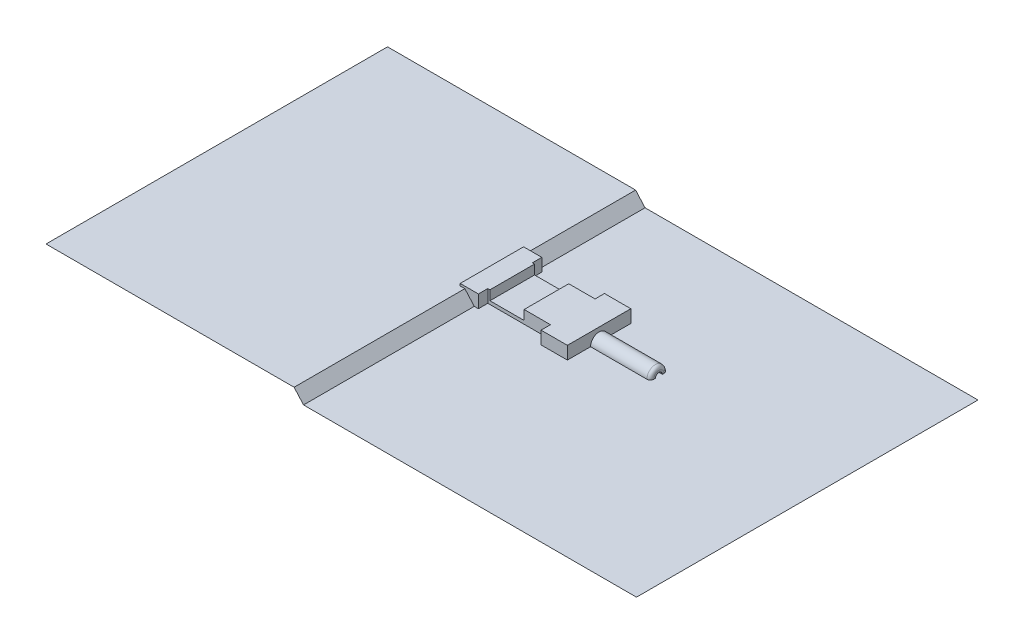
ISO-10303-21;
HEADER;
FILE_DESCRIPTION(('STEP AP214'),'2;1');
FILE_NAME('part.step','',(''),(''),'','','');
FILE_SCHEMA(('AUTOMOTIVE_DESIGN { 1 0 10303 214 1 1 1 1 }'));
ENDSEC;
DATA;
#1=APPLICATION_CONTEXT('core data for automotive mechanical design processes');
#2=APPLICATION_PROTOCOL_DEFINITION('international standard','automotive_design',2000,#1);
#3=PRODUCT_CONTEXT('',#1,'mechanical');
#4=PRODUCT('Part','Part','',(#3));
#5=PRODUCT_RELATED_PRODUCT_CATEGORY('part','',(#4));
#6=PRODUCT_DEFINITION_FORMATION('','',#4);
#7=PRODUCT_DEFINITION_CONTEXT('part definition',#1,'design');
#8=PRODUCT_DEFINITION('design','',#6,#7);
#9=PRODUCT_DEFINITION_SHAPE('','',#8);
#10=(LENGTH_UNIT() NAMED_UNIT(*) SI_UNIT(.MILLI.,.METRE.));
#11=(NAMED_UNIT(*) PLANE_ANGLE_UNIT() SI_UNIT($,.RADIAN.));
#12=(NAMED_UNIT(*) SI_UNIT($,.STERADIAN.) SOLID_ANGLE_UNIT());
#13=UNCERTAINTY_MEASURE_WITH_UNIT(LENGTH_MEASURE(1.E-05),#10,'distance_accuracy_value','');
#14=(GEOMETRIC_REPRESENTATION_CONTEXT(3) GLOBAL_UNCERTAINTY_ASSIGNED_CONTEXT((#13)) GLOBAL_UNIT_ASSIGNED_CONTEXT((#10,
#11,#12)) REPRESENTATION_CONTEXT('',''));
#15=CARTESIAN_POINT('',(0.,0.,0.));
#16=DIRECTION('',(0.,0.,1.));
#17=DIRECTION('',(1.,0.,0.));
#18=AXIS2_PLACEMENT_3D('',#15,#16,#17);
#19=CARTESIAN_POINT('',(-40.7086650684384,3.7238100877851,18.5695273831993));
#20=DIRECTION('',(0.,1.,0.));
#21=DIRECTION('',(0.,0.,1.));
#22=AXIS2_PLACEMENT_3D('',#19,#20,#21);
#23=PLANE('',#22);
#24=DIRECTION('',(-1.,0.,0.));
#25=VECTOR('',#24,1.);
#26=CARTESIAN_POINT('',(-40.7086650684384,3.7238100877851,118.569527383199));
#27=LINE('',#26,#25);
#28=CARTESIAN_POINT('',(-19.3295566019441,3.7238100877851,118.569527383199));
#29=VERTEX_POINT('',#28);
#30=CARTESIAN_POINT('',(-164.622270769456,3.7238100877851,118.569527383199));
#31=VERTEX_POINT('',#30);
#32=EDGE_CURVE('E50',#29,#31,#27,.T.);
#33=ORIENTED_EDGE('',*,*,#32,.F.);
#34=DIRECTION('',(0.,0.,1.));
#35=VECTOR('',#34,1.);
#36=CARTESIAN_POINT('',(-19.3295566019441,3.7238100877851,18.5695273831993));
#37=LINE('',#36,#35);
#38=CARTESIAN_POINT('',(-19.3295566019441,3.7238100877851,-81.4304726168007));
#39=VERTEX_POINT('',#38);
#40=EDGE_CURVE('E87',#39,#29,#37,.T.);
#41=ORIENTED_EDGE('',*,*,#40,.F.);
#42=DIRECTION('',(-1.,0.,0.));
#43=VECTOR('',#42,1.);
#44=CARTESIAN_POINT('',(-40.7086650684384,3.7238100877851,-81.4304726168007));
#45=LINE('',#44,#43);
#46=CARTESIAN_POINT('',(-164.622270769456,3.7238100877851,-81.4304726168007));
#47=VERTEX_POINT('',#46);
#48=EDGE_CURVE('E85',#39,#47,#45,.T.);
#49=ORIENTED_EDGE('',*,*,#48,.T.);
#50=DIRECTION('',(0.,0.,1.));
#51=VECTOR('',#50,1.);
#52=CARTESIAN_POINT('',(-164.622270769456,3.7238100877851,18.5695273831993));
#53=LINE('',#52,#51);
#54=EDGE_CURVE('E12',#47,#31,#53,.T.);
#55=ORIENTED_EDGE('',*,*,#54,.T.);
#56=EDGE_LOOP('',(#33,#41,#49,#55));
#57=FACE_BOUND('',#56,.T.);
#58=ADVANCED_FACE('F43',(#57),#23,.T.);
#59=CARTESIAN_POINT('',(-13.811539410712,-2.5,18.5695273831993));
#60=DIRECTION('',(0.748259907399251,0.663405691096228,0.));
#61=DIRECTION('',(-0.663405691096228,0.748259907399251,0.));
#62=AXIS2_PLACEMENT_3D('',#59,#60,#61);
#63=PLANE('',#62);
#64=DIRECTION('',(-0.663405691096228,0.748259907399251,0.));
#65=VECTOR('',#64,1.);
#66=CARTESIAN_POINT('',(-13.811539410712,-2.5,118.569527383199));
#67=LINE('',#66,#65);
#68=CARTESIAN_POINT('',(-13.811539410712,-2.5,118.569527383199));
#69=VERTEX_POINT('',#68);
#70=EDGE_CURVE('E65',#69,#29,#67,.T.);
#71=ORIENTED_EDGE('',*,*,#70,.F.);
#72=DIRECTION('',(0.,0.,1.));
#73=VECTOR('',#72,1.);
#74=CARTESIAN_POINT('',(-13.811539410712,-2.5,18.5695273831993));
#75=LINE('',#74,#73);
#76=CARTESIAN_POINT('',(-13.811539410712,-2.5,-81.4304726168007));
#77=VERTEX_POINT('',#76);
#78=EDGE_CURVE('E105',#77,#69,#75,.T.);
#79=ORIENTED_EDGE('',*,*,#78,.F.);
#80=DIRECTION('',(-0.663405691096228,0.748259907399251,0.));
#81=VECTOR('',#80,1.);
#82=CARTESIAN_POINT('',(-13.811539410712,-2.5,-81.4304726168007));
#83=LINE('',#82,#81);
#84=EDGE_CURVE('E89',#77,#39,#83,.T.);
#85=ORIENTED_EDGE('',*,*,#84,.T.);
#86=ORIENTED_EDGE('',*,*,#40,.T.);
#87=EDGE_LOOP('',(#71,#79,#85,#86));
#88=FACE_BOUND('',#87,.T.);
#89=ADVANCED_FACE('F110',(#88),#63,.T.);
#90=CARTESIAN_POINT('',(75.7086650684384,-2.5,18.5695273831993));
#91=DIRECTION('',(0.,1.,0.));
#92=DIRECTION('',(0.,0.,1.));
#93=AXIS2_PLACEMENT_3D('',#90,#91,#92);
#94=PLANE('',#93);
#95=DIRECTION('',(-1.,0.,0.));
#96=VECTOR('',#95,1.);
#97=CARTESIAN_POINT('',(75.7086650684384,-2.5,118.569527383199));
#98=LINE('',#97,#96);
#99=CARTESIAN_POINT('',(181.173511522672,-2.5,118.569527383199));
#100=VERTEX_POINT('',#99);
#101=EDGE_CURVE('E57',#100,#69,#98,.T.);
#102=ORIENTED_EDGE('',*,*,#101,.F.);
#103=DIRECTION('',(0.,0.,1.));
#104=VECTOR('',#103,1.);
#105=CARTESIAN_POINT('',(181.173511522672,-2.5,18.5695273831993));
#106=LINE('',#105,#104);
#107=CARTESIAN_POINT('',(181.173511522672,-2.5,-81.4304726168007));
#108=VERTEX_POINT('',#107);
#109=EDGE_CURVE('E96',#108,#100,#106,.T.);
#110=ORIENTED_EDGE('',*,*,#109,.F.);
#111=DIRECTION('',(-1.,0.,0.));
#112=VECTOR('',#111,1.);
#113=CARTESIAN_POINT('',(75.7086650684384,-2.5,-81.4304726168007));
#114=LINE('',#113,#112);
#115=EDGE_CURVE('E98',#108,#77,#114,.T.);
#116=ORIENTED_EDGE('',*,*,#115,.T.);
#117=ORIENTED_EDGE('',*,*,#78,.T.);
#118=EDGE_LOOP('',(#102,#110,#116,#117));
#119=FACE_BOUND('',#118,.T.);
#120=ADVANCED_FACE('F44',(#119),#94,.T.);
#121=OPEN_SHELL('',(#58,#89,#120));
#122=SHELL_BASED_SURFACE_MODEL('B2',(#121));
#123=CARTESIAN_POINT('',(-40.7086650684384,5.,18.5695273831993));
#124=DIRECTION('',(0.,0.,-1.));
#125=DIRECTION('',(-1.,0.,0.));
#126=AXIS2_PLACEMENT_3D('',#123,#124,#125);
#127=PLANE('',#126);
#128=DIRECTION('',(1.,0.,0.));
#129=VECTOR('',#128,1.);
#130=CARTESIAN_POINT('',(-40.7086650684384,3.7238100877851,18.5695273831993));
#131=LINE('',#130,#129);
#132=CARTESIAN_POINT('',(-40.7086650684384,3.7238100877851,18.5695273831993));
#133=VERTEX_POINT('',#132);
#134=CARTESIAN_POINT('',(-22.0774506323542,3.7238100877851,18.5695273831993));
#135=VERTEX_POINT('',#134);
#136=EDGE_CURVE('E383',#133,#135,#131,.T.);
#137=ORIENTED_EDGE('',*,*,#136,.F.);
#138=DIRECTION('',(0.,-1.,0.));
#139=VECTOR('',#138,1.);
#140=CARTESIAN_POINT('',(-40.7086650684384,5.,18.5695273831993));
#141=LINE('',#140,#139);
#142=CARTESIAN_POINT('',(-40.7086650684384,0.,18.5695273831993));
#143=VERTEX_POINT('',#142);
#144=EDGE_CURVE('E393',#133,#143,#141,.T.);
#145=ORIENTED_EDGE('',*,*,#144,.T.);
#146=DIRECTION('',(-1.,0.,0.));
#147=VECTOR('',#146,1.);
#148=CARTESIAN_POINT('',(-40.7086650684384,0.,18.5695273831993));
#149=LINE('',#148,#147);
#150=CARTESIAN_POINT('',(-22.0774506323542,0.,18.5695273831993));
#151=VERTEX_POINT('',#150);
#152=EDGE_CURVE('E602',#151,#143,#149,.T.);
#153=ORIENTED_EDGE('',*,*,#152,.F.);
#154=DIRECTION('',(-0.381591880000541,0.924330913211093,0.));
#155=VECTOR('',#154,1.);
#156=CARTESIAN_POINT('',(-22.0774506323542,0.,18.5695273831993));
#157=LINE('',#156,#155);
#158=CARTESIAN_POINT('',(-17.9491468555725,-10.,18.5695273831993));
#159=VERTEX_POINT('',#158);
#160=EDGE_CURVE('E594',#159,#151,#157,.T.);
#161=ORIENTED_EDGE('',*,*,#160,.F.);
#162=DIRECTION('',(1.,0.,0.));
#163=VECTOR('',#162,1.);
#164=CARTESIAN_POINT('',(-40.7086650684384,-10.,18.5695273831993));
#165=LINE('',#164,#163);
#166=CARTESIAN_POINT('',(-11.3977082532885,-10.,18.5695273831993));
#167=VERTEX_POINT('',#166);
#168=EDGE_CURVE('E616',#159,#167,#165,.T.);
#169=ORIENTED_EDGE('',*,*,#168,.T.);
#170=DIRECTION('',(0.,1.,0.));
#171=VECTOR('',#170,1.);
#172=CARTESIAN_POINT('',(-11.3977082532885,-10.001,18.5695273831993));
#173=LINE('',#172,#171);
#174=CARTESIAN_POINT('',(-11.3977082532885,5.,18.5695273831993));
#175=VERTEX_POINT('',#174);
#176=EDGE_CURVE('E538',#167,#175,#173,.T.);
#177=ORIENTED_EDGE('',*,*,#176,.T.);
#178=DIRECTION('',(1.,0.,0.));
#179=VECTOR('',#178,1.);
#180=CARTESIAN_POINT('',(-40.7086650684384,5.,18.5695273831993));
#181=LINE('',#180,#179);
#182=CARTESIAN_POINT('',(-22.0774506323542,5.,18.5695273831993));
#183=VERTEX_POINT('',#182);
#184=EDGE_CURVE('E627',#183,#175,#181,.T.);
#185=ORIENTED_EDGE('',*,*,#184,.F.);
#186=DIRECTION('',(0.,1.,0.));
#187=VECTOR('',#186,1.);
#188=CARTESIAN_POINT('',(-22.0774506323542,3.7238100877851,18.5695273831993));
#189=LINE('',#188,#187);
#190=EDGE_CURVE('E184',#135,#183,#189,.T.);
#191=ORIENTED_EDGE('',*,*,#190,.F.);
#192=EDGE_LOOP('',(#137,#145,#153,#161,#169,#177,#185,#191));
#193=FACE_BOUND('',#192,.T.);
#194=ADVANCED_FACE('F169',(#193),#127,.F.);
#195=CARTESIAN_POINT('',(-40.7086650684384,5.,-18.5695273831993));
#196=DIRECTION('',(1.,0.,0.));
#197=DIRECTION('',(0.,0.,-1.));
#198=AXIS2_PLACEMENT_3D('',#195,#196,#197);
#199=PLANE('',#198);
#200=DIRECTION('',(0.,0.,-1.));
#201=VECTOR('',#200,1.);
#202=CARTESIAN_POINT('',(-40.7086650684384,3.7238100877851,18.5695273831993));
#203=LINE('',#202,#201);
#204=CARTESIAN_POINT('',(-40.7086650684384,3.7238100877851,-18.5695273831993));
#205=VERTEX_POINT('',#204);
#206=EDGE_CURVE('E379',#133,#205,#203,.T.);
#207=ORIENTED_EDGE('',*,*,#206,.T.);
#208=DIRECTION('',(0.,-1.,0.));
#209=VECTOR('',#208,1.);
#210=CARTESIAN_POINT('',(-40.7086650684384,5.,-18.5695273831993));
#211=LINE('',#210,#209);
#212=CARTESIAN_POINT('',(-40.7086650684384,0.,-18.5695273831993));
#213=VERTEX_POINT('',#212);
#214=EDGE_CURVE('E635',#205,#213,#211,.T.);
#215=ORIENTED_EDGE('',*,*,#214,.T.);
#216=DIRECTION('',(0.,0.,1.));
#217=VECTOR('',#216,1.);
#218=CARTESIAN_POINT('',(-40.7086650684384,0.,-18.5695273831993));
#219=LINE('',#218,#217);
#220=EDGE_CURVE('E400',#213,#143,#219,.T.);
#221=ORIENTED_EDGE('',*,*,#220,.T.);
#222=ORIENTED_EDGE('',*,*,#144,.F.);
#223=EDGE_LOOP('',(#207,#215,#221,#222));
#224=FACE_BOUND('',#223,.T.);
#225=ADVANCED_FACE('F171',(#224),#199,.F.);
#226=CARTESIAN_POINT('',(-40.7086650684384,5.,-18.5695273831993));
#227=DIRECTION('',(0.,0.,1.));
#228=DIRECTION('',(1.,0.,0.));
#229=AXIS2_PLACEMENT_3D('',#226,#227,#228);
#230=PLANE('',#229);
#231=DIRECTION('',(-1.,0.,0.));
#232=VECTOR('',#231,1.);
#233=CARTESIAN_POINT('',(-40.7086650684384,3.7238100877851,-18.5695273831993));
#234=LINE('',#233,#232);
#235=CARTESIAN_POINT('',(-22.0774506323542,3.7238100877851,-18.5695273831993));
#236=VERTEX_POINT('',#235);
#237=EDGE_CURVE('E385',#236,#205,#234,.T.);
#238=ORIENTED_EDGE('',*,*,#237,.F.);
#239=DIRECTION('',(0.,-1.,0.));
#240=VECTOR('',#239,1.);
#241=CARTESIAN_POINT('',(-22.0774506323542,5.00000000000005,-18.5695273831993));
#242=LINE('',#241,#240);
#243=CARTESIAN_POINT('',(-22.0774506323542,5.,-18.5695273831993));
#244=VERTEX_POINT('',#243);
#245=EDGE_CURVE('E437',#244,#236,#242,.T.);
#246=ORIENTED_EDGE('',*,*,#245,.F.);
#247=DIRECTION('',(-1.,0.,0.));
#248=VECTOR('',#247,1.);
#249=CARTESIAN_POINT('',(-40.7086650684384,5.,-18.5695273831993));
#250=LINE('',#249,#248);
#251=CARTESIAN_POINT('',(-11.3977082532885,5.,-18.5695273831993));
#252=VERTEX_POINT('',#251);
#253=EDGE_CURVE('E631',#252,#244,#250,.T.);
#254=ORIENTED_EDGE('',*,*,#253,.F.);
#255=DIRECTION('',(0.,1.,0.));
#256=VECTOR('',#255,1.);
#257=CARTESIAN_POINT('',(-11.3977082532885,-10.001,-18.5695273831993));
#258=LINE('',#257,#256);
#259=CARTESIAN_POINT('',(-11.3977082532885,-10.,-18.5695273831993));
#260=VERTEX_POINT('',#259);
#261=EDGE_CURVE('E494',#260,#252,#258,.T.);
#262=ORIENTED_EDGE('',*,*,#261,.F.);
#263=DIRECTION('',(-1.,0.,0.));
#264=VECTOR('',#263,1.);
#265=CARTESIAN_POINT('',(-40.7086650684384,-10.,-18.5695273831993));
#266=LINE('',#265,#264);
#267=CARTESIAN_POINT('',(-17.9491468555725,-10.,-18.5695273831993));
#268=VERTEX_POINT('',#267);
#269=EDGE_CURVE('E622',#260,#268,#266,.T.);
#270=ORIENTED_EDGE('',*,*,#269,.T.);
#271=DIRECTION('',(-0.381591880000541,0.924330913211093,0.));
#272=VECTOR('',#271,1.);
#273=CARTESIAN_POINT('',(-22.0774506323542,0.,-18.5695273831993));
#274=LINE('',#273,#272);
#275=CARTESIAN_POINT('',(-22.0774506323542,0.,-18.5695273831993));
#276=VERTEX_POINT('',#275);
#277=EDGE_CURVE('E604',#268,#276,#274,.T.);
#278=ORIENTED_EDGE('',*,*,#277,.T.);
#279=DIRECTION('',(-1.,0.,0.));
#280=VECTOR('',#279,1.);
#281=CARTESIAN_POINT('',(-40.7086650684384,0.,-18.5695273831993));
#282=LINE('',#281,#280);
#283=EDGE_CURVE('E607',#276,#213,#282,.T.);
#284=ORIENTED_EDGE('',*,*,#283,.T.);
#285=ORIENTED_EDGE('',*,*,#214,.F.);
#286=EDGE_LOOP('',(#238,#246,#254,#262,#270,#278,#284,#285));
#287=FACE_BOUND('',#286,.T.);
#288=ADVANCED_FACE('F741',(#287),#230,.F.);
#289=CARTESIAN_POINT('',(-40.7086650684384,5.,18.5695273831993));
#290=DIRECTION('',(0.,1.,0.));
#291=DIRECTION('',(0.,0.,1.));
#292=AXIS2_PLACEMENT_3D('',#289,#290,#291);
#293=PLANE('',#292);
#294=ORIENTED_EDGE('',*,*,#253,.T.);
#295=DIRECTION('',(0.,0.,-1.));
#296=VECTOR('',#295,1.);
#297=CARTESIAN_POINT('',(-22.0774506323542,5.,18.5695273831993));
#298=LINE('',#297,#296);
#299=EDGE_CURVE('E389',#183,#244,#298,.T.);
#300=ORIENTED_EDGE('',*,*,#299,.F.);
#301=ORIENTED_EDGE('',*,*,#184,.T.);
#302=DIRECTION('',(0.,0.,1.));
#303=VECTOR('',#302,1.);
#304=CARTESIAN_POINT('',(-11.3977082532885,5.,13.058004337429));
#305=LINE('',#304,#303);
#306=CARTESIAN_POINT('',(-11.3977082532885,5.,13.058004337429));
#307=VERTEX_POINT('',#306);
#308=EDGE_CURVE('E534',#307,#175,#305,.T.);
#309=ORIENTED_EDGE('',*,*,#308,.F.);
#310=DIRECTION('',(-1.,0.,0.));
#311=VECTOR('',#310,1.);
#312=CARTESIAN_POINT('',(25.2903479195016,5.,13.058004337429));
#313=LINE('',#312,#311);
#314=CARTESIAN_POINT('',(-10.1412679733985,5.,13.058004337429));
#315=VERTEX_POINT('',#314);
#316=EDGE_CURVE('E530',#315,#307,#313,.T.);
#317=ORIENTED_EDGE('',*,*,#316,.F.);
#318=DIRECTION('',(0.,0.,1.));
#319=VECTOR('',#318,1.);
#320=CARTESIAN_POINT('',(-10.1412679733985,5.,-18.5695273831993));
#321=LINE('',#320,#319);
#322=CARTESIAN_POINT('',(-10.1412679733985,5.,-13.058004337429));
#323=VERTEX_POINT('',#322);
#324=EDGE_CURVE('E586',#323,#315,#321,.T.);
#325=ORIENTED_EDGE('',*,*,#324,.F.);
#326=DIRECTION('',(1.,0.,0.));
#327=VECTOR('',#326,1.);
#328=CARTESIAN_POINT('',(25.2903479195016,5.,-13.0580043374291));
#329=LINE('',#328,#327);
#330=CARTESIAN_POINT('',(-11.3977082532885,5.,-13.058004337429));
#331=VERTEX_POINT('',#330);
#332=EDGE_CURVE('E490',#331,#323,#329,.T.);
#333=ORIENTED_EDGE('',*,*,#332,.F.);
#334=DIRECTION('',(0.,0.,1.));
#335=VECTOR('',#334,1.);
#336=CARTESIAN_POINT('',(-11.3977082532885,5.,-13.058004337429));
#337=LINE('',#336,#335);
#338=EDGE_CURVE('E486',#252,#331,#337,.T.);
#339=ORIENTED_EDGE('',*,*,#338,.F.);
#340=EDGE_LOOP('',(#294,#300,#301,#309,#317,#325,#333,#339));
#341=FACE_BOUND('',#340,.T.);
#342=ADVANCED_FACE('F708',(#341),#293,.T.);
#343=CARTESIAN_POINT('',(-34.9005323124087,-10.001,-8.94289846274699));
#344=DIRECTION('',(-1.,0.,0.));
#345=DIRECTION('',(0.,0.,1.));
#346=AXIS2_PLACEMENT_3D('',#343,#344,#345);
#347=PLANE('',#346);
#348=DIRECTION('',(0.,0.,-1.));
#349=VECTOR('',#348,1.);
#350=CARTESIAN_POINT('',(-34.9005323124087,3.7238100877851,-8.94289846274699));
#351=LINE('',#350,#349);
#352=CARTESIAN_POINT('',(-34.9005323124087,3.7238100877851,8.94289846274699));
#353=VERTEX_POINT('',#352);
#354=CARTESIAN_POINT('',(-34.9005323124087,3.7238100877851,-8.94289846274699));
#355=VERTEX_POINT('',#354);
#356=EDGE_CURVE('E1063',#353,#355,#351,.T.);
#357=ORIENTED_EDGE('',*,*,#356,.F.);
#358=DIRECTION('',(0.,1.,0.));
#359=VECTOR('',#358,1.);
#360=CARTESIAN_POINT('',(-34.9005323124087,-10.001,8.94289846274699));
#361=LINE('',#360,#359);
#362=CARTESIAN_POINT('',(-34.9005323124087,0.,8.94289846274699));
#363=VERTEX_POINT('',#362);
#364=EDGE_CURVE('E571',#363,#353,#361,.T.);
#365=ORIENTED_EDGE('',*,*,#364,.F.);
#366=DIRECTION('',(0.,0.,-1.));
#367=VECTOR('',#366,1.);
#368=CARTESIAN_POINT('',(-34.9005323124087,0.,-8.94289846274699));
#369=LINE('',#368,#367);
#370=CARTESIAN_POINT('',(-34.9005323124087,0.,-8.94289846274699));
#371=VERTEX_POINT('',#370);
#372=EDGE_CURVE('E568',#363,#371,#369,.T.);
#373=ORIENTED_EDGE('',*,*,#372,.T.);
#374=DIRECTION('',(0.,1.,0.));
#375=VECTOR('',#374,1.);
#376=CARTESIAN_POINT('',(-34.9005323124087,-10.001,-8.94289846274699));
#377=LINE('',#376,#375);
#378=EDGE_CURVE('E572',#371,#355,#377,.T.);
#379=ORIENTED_EDGE('',*,*,#378,.T.);
#380=EDGE_LOOP('',(#357,#365,#373,#379));
#381=FACE_BOUND('',#380,.T.);
#382=ADVANCED_FACE('F756',(#381),#347,.F.);
#383=CARTESIAN_POINT('',(-34.9005323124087,-10.001,-8.94289846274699));
#384=DIRECTION('',(0.,0.,-1.));
#385=DIRECTION('',(-1.,0.,0.));
#386=AXIS2_PLACEMENT_3D('',#383,#384,#385);
#387=PLANE('',#386);
#388=DIRECTION('',(1.,0.,0.));
#389=VECTOR('',#388,1.);
#390=CARTESIAN_POINT('',(-34.9005323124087,3.7238100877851,-8.94289846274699));
#391=LINE('',#390,#389);
#392=CARTESIAN_POINT('',(-24.1925625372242,3.7238100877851,-8.94289846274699));
#393=VERTEX_POINT('',#392);
#394=EDGE_CURVE('E192',#355,#393,#391,.T.);
#395=ORIENTED_EDGE('',*,*,#394,.F.);
#396=ORIENTED_EDGE('',*,*,#378,.F.);
#397=DIRECTION('',(1.,0.,0.));
#398=VECTOR('',#397,1.);
#399=CARTESIAN_POINT('',(-34.9005323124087,0.,-8.94289846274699));
#400=LINE('',#399,#398);
#401=CARTESIAN_POINT('',(-24.1925625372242,0.,-8.94289846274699));
#402=VERTEX_POINT('',#401);
#403=EDGE_CURVE('E565',#371,#402,#400,.T.);
#404=ORIENTED_EDGE('',*,*,#403,.T.);
#405=DIRECTION('',(0.,1.,0.));
#406=VECTOR('',#405,1.);
#407=CARTESIAN_POINT('',(-24.1925625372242,-10.001,-8.94289846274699));
#408=LINE('',#407,#406);
#409=EDGE_CURVE('E575',#402,#393,#408,.T.);
#410=ORIENTED_EDGE('',*,*,#409,.T.);
#411=EDGE_LOOP('',(#395,#396,#404,#410));
#412=FACE_BOUND('',#411,.T.);
#413=ADVANCED_FACE('F761',(#412),#387,.F.);
#414=CARTESIAN_POINT('',(-24.1925625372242,-10.001,-8.94289846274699));
#415=DIRECTION('',(1.,0.,0.));
#416=DIRECTION('',(0.,0.,-1.));
#417=AXIS2_PLACEMENT_3D('',#414,#415,#416);
#418=PLANE('',#417);
#419=DIRECTION('',(0.,0.,1.));
#420=VECTOR('',#419,1.);
#421=CARTESIAN_POINT('',(-24.1925625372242,3.7238100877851,-8.94289846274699));
#422=LINE('',#421,#420);
#423=CARTESIAN_POINT('',(-24.1925625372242,3.7238100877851,8.94289846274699));
#424=VERTEX_POINT('',#423);
#425=EDGE_CURVE('E396',#393,#424,#422,.T.);
#426=ORIENTED_EDGE('',*,*,#425,.F.);
#427=ORIENTED_EDGE('',*,*,#409,.F.);
#428=DIRECTION('',(0.,0.,1.));
#429=VECTOR('',#428,1.);
#430=CARTESIAN_POINT('',(-24.1925625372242,0.,-8.94289846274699));
#431=LINE('',#430,#429);
#432=CARTESIAN_POINT('',(-24.1925625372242,0.,8.94289846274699));
#433=VERTEX_POINT('',#432);
#434=EDGE_CURVE('E563',#402,#433,#431,.T.);
#435=ORIENTED_EDGE('',*,*,#434,.T.);
#436=DIRECTION('',(0.,1.,0.));
#437=VECTOR('',#436,1.);
#438=CARTESIAN_POINT('',(-24.1925625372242,-10.001,8.94289846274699));
#439=LINE('',#438,#437);
#440=EDGE_CURVE('E577',#433,#424,#439,.T.);
#441=ORIENTED_EDGE('',*,*,#440,.T.);
#442=EDGE_LOOP('',(#426,#427,#435,#441));
#443=FACE_BOUND('',#442,.T.);
#444=ADVANCED_FACE('F775',(#443),#418,.F.);
#445=CARTESIAN_POINT('',(-34.9005323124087,-10.001,8.94289846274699));
#446=DIRECTION('',(0.,0.,1.));
#447=DIRECTION('',(1.,0.,0.));
#448=AXIS2_PLACEMENT_3D('',#445,#446,#447);
#449=PLANE('',#448);
#450=DIRECTION('',(-1.,0.,0.));
#451=VECTOR('',#450,1.);
#452=CARTESIAN_POINT('',(-34.9005323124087,3.7238100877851,8.94289846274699));
#453=LINE('',#452,#451);
#454=EDGE_CURVE('E41',#424,#353,#453,.T.);
#455=ORIENTED_EDGE('',*,*,#454,.F.);
#456=ORIENTED_EDGE('',*,*,#440,.F.);
#457=DIRECTION('',(-1.,0.,0.));
#458=VECTOR('',#457,1.);
#459=CARTESIAN_POINT('',(-34.9005323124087,0.,8.94289846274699));
#460=LINE('',#459,#458);
#461=EDGE_CURVE('E574',#433,#363,#460,.T.);
#462=ORIENTED_EDGE('',*,*,#461,.T.);
#463=ORIENTED_EDGE('',*,*,#364,.T.);
#464=EDGE_LOOP('',(#455,#456,#462,#463));
#465=FACE_BOUND('',#464,.T.);
#466=ADVANCED_FACE('F771',(#465),#449,.F.);
#467=CARTESIAN_POINT('',(40.7086650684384,5.,-18.5695273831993));
#468=DIRECTION('',(-1.,0.,0.));
#469=DIRECTION('',(0.,0.,1.));
#470=AXIS2_PLACEMENT_3D('',#467,#468,#469);
#471=PLANE('',#470);
#472=DIRECTION('',(0.,-1.,0.));
#473=VECTOR('',#472,1.);
#474=CARTESIAN_POINT('',(40.7086650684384,5.,18.5695273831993));
#475=LINE('',#474,#473);
#476=CARTESIAN_POINT('',(40.7086650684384,5.,18.5695273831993));
#477=VERTEX_POINT('',#476);
#478=CARTESIAN_POINT('',(40.7086650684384,-10.,18.5695273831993));
#479=VERTEX_POINT('',#478);
#480=EDGE_CURVE('E402',#477,#479,#475,.T.);
#481=ORIENTED_EDGE('',*,*,#480,.T.);
#482=DIRECTION('',(0.,0.,-1.));
#483=VECTOR('',#482,1.);
#484=CARTESIAN_POINT('',(40.7086650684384,-10.,-18.5695273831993));
#485=LINE('',#484,#483);
#486=CARTESIAN_POINT('',(40.7086650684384,-10.,-18.5695273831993));
#487=VERTEX_POINT('',#486);
#488=EDGE_CURVE('E619',#479,#487,#485,.T.);
#489=ORIENTED_EDGE('',*,*,#488,.T.);
#490=DIRECTION('',(0.,-1.,0.));
#491=VECTOR('',#490,1.);
#492=CARTESIAN_POINT('',(40.7086650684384,5.,-18.5695273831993));
#493=LINE('',#492,#491);
#494=CARTESIAN_POINT('',(40.7086650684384,5.,-18.5695273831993));
#495=VERTEX_POINT('',#494);
#496=EDGE_CURVE('E408',#495,#487,#493,.T.);
#497=ORIENTED_EDGE('',*,*,#496,.F.);
#498=DIRECTION('',(0.,0.,-1.));
#499=VECTOR('',#498,1.);
#500=CARTESIAN_POINT('',(40.7086650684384,5.,-18.5695273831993));
#501=LINE('',#500,#499);
#502=EDGE_CURVE('E629',#477,#495,#501,.T.);
#503=ORIENTED_EDGE('',*,*,#502,.F.);
#504=EDGE_LOOP('',(#481,#489,#497,#503));
#505=FACE_BOUND('',#504,.T.);
#506=CARTESIAN_POINT('',(40.7086650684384,-2.5,0.));
#507=DIRECTION('',(-1.,0.,0.));
#508=DIRECTION('',(0.,0.,1.));
#509=AXIS2_PLACEMENT_3D('',#506,#507,#508);
#510=CIRCLE('',#509,5.);
#511=CARTESIAN_POINT('',(40.7086650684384,-2.5,5.00000000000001));
#512=VERTEX_POINT('',#511);
#513=EDGE_CURVE('E401',#512,#512,#510,.F.);
#514=ORIENTED_EDGE('',*,*,#513,.F.);
#515=EDGE_LOOP('',(#514));
#516=FACE_BOUND('',#515,.T.);
#517=ADVANCED_FACE('F644',(#505,#516),#471,.F.);
#518=CARTESIAN_POINT('',(25.2903479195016,-10.,-18.5695273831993));
#519=VERTEX_POINT('',#518);
#520=EDGE_CURVE('E623',#487,#519,#266,.T.);
#521=ORIENTED_EDGE('',*,*,#520,.T.);
#522=DIRECTION('',(0.,1.,0.));
#523=VECTOR('',#522,1.);
#524=CARTESIAN_POINT('',(25.2903479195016,-10.001,-18.5695273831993));
#525=LINE('',#524,#523);
#526=CARTESIAN_POINT('',(25.2903479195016,5.,-18.5695273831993));
#527=VERTEX_POINT('',#526);
#528=EDGE_CURVE('E495',#519,#527,#525,.T.);
#529=ORIENTED_EDGE('',*,*,#528,.T.);
#530=EDGE_CURVE('E632',#495,#527,#250,.T.);
#531=ORIENTED_EDGE('',*,*,#530,.F.);
#532=ORIENTED_EDGE('',*,*,#496,.T.);
#533=EDGE_LOOP('',(#521,#529,#531,#532));
#534=FACE_BOUND('',#533,.T.);
#535=ADVANCED_FACE('F639',(#534),#230,.F.);
#536=CARTESIAN_POINT('',(-40.7086650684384,-10.,18.5695273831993));
#537=DIRECTION('',(0.,1.,0.));
#538=DIRECTION('',(0.,0.,1.));
#539=AXIS2_PLACEMENT_3D('',#536,#537,#538);
#540=PLANE('',#539);
#541=DIRECTION('',(0.,0.,-1.));
#542=VECTOR('',#541,1.);
#543=CARTESIAN_POINT('',(-11.3977082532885,-10.,-13.058004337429));
#544=LINE('',#543,#542);
#545=CARTESIAN_POINT('',(-11.3977082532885,-10.,-13.058004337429));
#546=VERTEX_POINT('',#545);
#547=EDGE_CURVE('E498',#546,#260,#544,.T.);
#548=ORIENTED_EDGE('',*,*,#547,.F.);
#549=DIRECTION('',(-1.,0.,0.));
#550=VECTOR('',#549,1.);
#551=CARTESIAN_POINT('',(25.2903479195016,-10.,-13.0580043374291));
#552=LINE('',#551,#550);
#553=CARTESIAN_POINT('',(-7.62838741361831,-10.,-13.058004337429));
#554=VERTEX_POINT('',#553);
#555=EDGE_CURVE('E480',#554,#546,#552,.T.);
#556=ORIENTED_EDGE('',*,*,#555,.F.);
#557=DIRECTION('',(0.,0.,1.));
#558=VECTOR('',#557,1.);
#559=CARTESIAN_POINT('',(-7.62838741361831,-10.,-18.5695273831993));
#560=LINE('',#559,#558);
#561=CARTESIAN_POINT('',(-7.62838741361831,-10.,13.058004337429));
#562=VERTEX_POINT('',#561);
#563=EDGE_CURVE('E584',#554,#562,#560,.T.);
#564=ORIENTED_EDGE('',*,*,#563,.T.);
#565=DIRECTION('',(1.,0.,0.));
#566=VECTOR('',#565,1.);
#567=CARTESIAN_POINT('',(25.2903479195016,-10.,13.058004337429));
#568=LINE('',#567,#566);
#569=CARTESIAN_POINT('',(-11.3977082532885,-10.,13.058004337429));
#570=VERTEX_POINT('',#569);
#571=EDGE_CURVE('E557',#570,#562,#568,.T.);
#572=ORIENTED_EDGE('',*,*,#571,.F.);
#573=DIRECTION('',(0.,0.,-1.));
#574=VECTOR('',#573,1.);
#575=CARTESIAN_POINT('',(-11.3977082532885,-10.,13.058004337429));
#576=LINE('',#575,#574);
#577=EDGE_CURVE('E524',#167,#570,#576,.T.);
#578=ORIENTED_EDGE('',*,*,#577,.F.);
#579=ORIENTED_EDGE('',*,*,#168,.F.);
#580=DIRECTION('',(0.,0.,1.));
#581=VECTOR('',#580,1.);
#582=CARTESIAN_POINT('',(-17.9491468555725,-10.,-18.5695273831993));
#583=LINE('',#582,#581);
#584=EDGE_CURVE('E610',#268,#159,#583,.T.);
#585=ORIENTED_EDGE('',*,*,#584,.F.);
#586=ORIENTED_EDGE('',*,*,#269,.F.);
#587=EDGE_LOOP('',(#548,#556,#564,#572,#578,#579,#585,#586));
#588=FACE_BOUND('',#587,.T.);
#589=ADVANCED_FACE('F694',(#588),#540,.F.);
#590=DIRECTION('',(0.,0.,-1.));
#591=VECTOR('',#590,1.);
#592=CARTESIAN_POINT('',(25.2903479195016,5.,-18.5695273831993));
#593=LINE('',#592,#591);
#594=CARTESIAN_POINT('',(25.2903479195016,5.,-13.0580043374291));
#595=VERTEX_POINT('',#594);
#596=EDGE_CURVE('E492',#595,#527,#593,.T.);
#597=ORIENTED_EDGE('',*,*,#596,.F.);
#598=CARTESIAN_POINT('',(9.87203077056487,5.,-13.0580043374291));
#599=VERTEX_POINT('',#598);
#600=EDGE_CURVE('E489',#599,#595,#329,.T.);
#601=ORIENTED_EDGE('',*,*,#600,.F.);
#602=DIRECTION('',(0.,0.,1.));
#603=VECTOR('',#602,1.);
#604=CARTESIAN_POINT('',(9.87203077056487,5.,-18.5695273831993));
#605=LINE('',#604,#603);
#606=CARTESIAN_POINT('',(9.87203077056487,5.,13.058004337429));
#607=VERTEX_POINT('',#606);
#608=EDGE_CURVE('E592',#599,#607,#605,.T.);
#609=ORIENTED_EDGE('',*,*,#608,.T.);
#610=CARTESIAN_POINT('',(25.2903479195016,5.,13.058004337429));
#611=VERTEX_POINT('',#610);
#612=EDGE_CURVE('E531',#611,#607,#313,.T.);
#613=ORIENTED_EDGE('',*,*,#612,.F.);
#614=DIRECTION('',(0.,0.,-1.));
#615=VECTOR('',#614,1.);
#616=CARTESIAN_POINT('',(25.2903479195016,5.,18.5695273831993));
#617=LINE('',#616,#615);
#618=CARTESIAN_POINT('',(25.2903479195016,5.,18.5695273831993));
#619=VERTEX_POINT('',#618);
#620=EDGE_CURVE('E527',#619,#611,#617,.T.);
#621=ORIENTED_EDGE('',*,*,#620,.F.);
#622=EDGE_CURVE('E626',#619,#477,#181,.T.);
#623=ORIENTED_EDGE('',*,*,#622,.T.);
#624=ORIENTED_EDGE('',*,*,#502,.T.);
#625=ORIENTED_EDGE('',*,*,#530,.T.);
#626=EDGE_LOOP('',(#597,#601,#609,#613,#621,#623,#624,#625));
#627=FACE_BOUND('',#626,.T.);
#628=ADVANCED_FACE('F658',(#627),#293,.T.);
#629=ORIENTED_EDGE('',*,*,#622,.F.);
#630=DIRECTION('',(0.,1.,0.));
#631=VECTOR('',#630,1.);
#632=CARTESIAN_POINT('',(25.2903479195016,-10.001,18.5695273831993));
#633=LINE('',#632,#631);
#634=CARTESIAN_POINT('',(25.2903479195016,-10.,18.5695273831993));
#635=VERTEX_POINT('',#634);
#636=EDGE_CURVE('E537',#635,#619,#633,.T.);
#637=ORIENTED_EDGE('',*,*,#636,.F.);
#638=EDGE_CURVE('E612',#635,#479,#165,.T.);
#639=ORIENTED_EDGE('',*,*,#638,.T.);
#640=ORIENTED_EDGE('',*,*,#480,.F.);
#641=EDGE_LOOP('',(#629,#637,#639,#640));
#642=FACE_BOUND('',#641,.T.);
#643=ADVANCED_FACE('F665',(#642),#127,.F.);
#644=DIRECTION('',(-1.,0.,0.));
#645=VECTOR('',#644,1.);
#646=CARTESIAN_POINT('',(37.7086650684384,-10.,5.00000000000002));
#647=LINE('',#646,#645);
#648=CARTESIAN_POINT('',(37.7086650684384,-10.,5.00000000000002));
#649=VERTEX_POINT('',#648);
#650=CARTESIAN_POINT('',(28.7663146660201,-10.,5.00000000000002));
#651=VERTEX_POINT('',#650);
#652=EDGE_CURVE('E446',#649,#651,#647,.T.);
#653=ORIENTED_EDGE('',*,*,#652,.F.);
#654=DIRECTION('',(0.,0.,1.));
#655=VECTOR('',#654,1.);
#656=CARTESIAN_POINT('',(37.7086650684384,-10.,5.00000000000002));
#657=LINE('',#656,#655);
#658=CARTESIAN_POINT('',(37.7086650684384,-10.,-4.99999999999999));
#659=VERTEX_POINT('',#658);
#660=EDGE_CURVE('E440',#659,#649,#657,.T.);
#661=ORIENTED_EDGE('',*,*,#660,.F.);
#662=DIRECTION('',(1.,0.,0.));
#663=VECTOR('',#662,1.);
#664=CARTESIAN_POINT('',(37.7086650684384,-10.,-4.99999999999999));
#665=LINE('',#664,#663);
#666=CARTESIAN_POINT('',(28.7663146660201,-10.,-4.99999999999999));
#667=VERTEX_POINT('',#666);
#668=EDGE_CURVE('E452',#667,#659,#665,.T.);
#669=ORIENTED_EDGE('',*,*,#668,.F.);
#670=DIRECTION('',(0.,0.,-1.));
#671=VECTOR('',#670,1.);
#672=CARTESIAN_POINT('',(28.7663146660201,-10.,5.00000000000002));
#673=LINE('',#672,#671);
#674=EDGE_CURVE('E449',#651,#667,#673,.T.);
#675=ORIENTED_EDGE('',*,*,#674,.F.);
#676=EDGE_LOOP('',(#653,#661,#669,#675));
#677=FACE_BOUND('',#676,.T.);
#678=DIRECTION('',(-1.,0.,0.));
#679=VECTOR('',#678,1.);
#680=CARTESIAN_POINT('',(25.2903479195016,-10.,-13.0580043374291));
#681=LINE('',#680,#679);
#682=CARTESIAN_POINT('',(25.2903479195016,-10.,-13.0580043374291));
#683=VERTEX_POINT('',#682);
#684=CARTESIAN_POINT('',(6.01296419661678,-10.,-13.058004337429));
#685=VERTEX_POINT('',#684);
#686=EDGE_CURVE('E511',#683,#685,#681,.T.);
#687=ORIENTED_EDGE('',*,*,#686,.F.);
#688=DIRECTION('',(0.,0.,1.));
#689=VECTOR('',#688,1.);
#690=CARTESIAN_POINT('',(25.2903479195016,-10.,-18.5695273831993));
#691=LINE('',#690,#689);
#692=EDGE_CURVE('E483',#519,#683,#691,.T.);
#693=ORIENTED_EDGE('',*,*,#692,.F.);
#694=ORIENTED_EDGE('',*,*,#520,.F.);
#695=ORIENTED_EDGE('',*,*,#488,.F.);
#696=ORIENTED_EDGE('',*,*,#638,.F.);
#697=DIRECTION('',(0.,0.,1.));
#698=VECTOR('',#697,1.);
#699=CARTESIAN_POINT('',(25.2903479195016,-10.,18.5695273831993));
#700=LINE('',#699,#698);
#701=CARTESIAN_POINT('',(25.2903479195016,-10.,13.058004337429));
#702=VERTEX_POINT('',#701);
#703=EDGE_CURVE('E541',#702,#635,#700,.T.);
#704=ORIENTED_EDGE('',*,*,#703,.F.);
#705=DIRECTION('',(1.,0.,0.));
#706=VECTOR('',#705,1.);
#707=CARTESIAN_POINT('',(25.2903479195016,-10.,13.058004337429));
#708=LINE('',#707,#706);
#709=CARTESIAN_POINT('',(6.01296419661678,-10.,13.058004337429));
#710=VERTEX_POINT('',#709);
#711=EDGE_CURVE('E521',#710,#702,#708,.T.);
#712=ORIENTED_EDGE('',*,*,#711,.F.);
#713=DIRECTION('',(0.,0.,1.));
#714=VECTOR('',#713,1.);
#715=CARTESIAN_POINT('',(6.01296419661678,-10.,-18.5695273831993));
#716=LINE('',#715,#714);
#717=EDGE_CURVE('E583',#685,#710,#716,.T.);
#718=ORIENTED_EDGE('',*,*,#717,.F.);
#719=EDGE_LOOP('',(#687,#693,#694,#695,#696,#704,#712,#718));
#720=FACE_BOUND('',#719,.T.);
#721=ADVANCED_FACE('F651',(#677,#720),#540,.F.);
#722=CARTESIAN_POINT('',(-40.7086650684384,0.,-18.5695273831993));
#723=DIRECTION('',(0.,1.,0.));
#724=DIRECTION('',(0.,0.,1.));
#725=AXIS2_PLACEMENT_3D('',#722,#723,#724);
#726=PLANE('',#725);
#727=ORIENTED_EDGE('',*,*,#403,.F.);
#728=ORIENTED_EDGE('',*,*,#372,.F.);
#729=ORIENTED_EDGE('',*,*,#461,.F.);
#730=ORIENTED_EDGE('',*,*,#434,.F.);
#731=EDGE_LOOP('',(#727,#728,#729,#730));
#732=FACE_BOUND('',#731,.T.);
#733=ORIENTED_EDGE('',*,*,#152,.T.);
#734=ORIENTED_EDGE('',*,*,#220,.F.);
#735=ORIENTED_EDGE('',*,*,#283,.F.);
#736=DIRECTION('',(0.,0.,1.));
#737=VECTOR('',#736,1.);
#738=CARTESIAN_POINT('',(-22.0774506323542,0.,-18.5695273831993));
#739=LINE('',#738,#737);
#740=EDGE_CURVE('E613',#276,#151,#739,.T.);
#741=ORIENTED_EDGE('',*,*,#740,.T.);
#742=EDGE_LOOP('',(#733,#734,#735,#741));
#743=FACE_BOUND('',#742,.T.);
#744=ADVANCED_FACE('F733',(#732,#743),#726,.F.);
#745=CARTESIAN_POINT('',(-22.0774506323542,0.,-18.5695273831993));
#746=DIRECTION('',(0.924330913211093,0.381591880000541,0.));
#747=DIRECTION('',(-0.381591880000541,0.924330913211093,0.));
#748=AXIS2_PLACEMENT_3D('',#745,#746,#747);
#749=PLANE('',#748);
#750=ORIENTED_EDGE('',*,*,#160,.T.);
#751=ORIENTED_EDGE('',*,*,#740,.F.);
#752=ORIENTED_EDGE('',*,*,#277,.F.);
#753=ORIENTED_EDGE('',*,*,#584,.T.);
#754=EDGE_LOOP('',(#750,#751,#752,#753));
#755=FACE_BOUND('',#754,.T.);
#756=ADVANCED_FACE('F726',(#755),#749,.F.);
#757=CARTESIAN_POINT('',(9.87203077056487,-0.570466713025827,-18.5695273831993));
#758=DIRECTION('',(1.,0.,0.));
#759=DIRECTION('',(0.,0.,-1.));
#760=AXIS2_PLACEMENT_3D('',#757,#758,#759);
#761=PLANE('',#760);
#762=ORIENTED_EDGE('',*,*,#608,.F.);
#763=DIRECTION('',(0.,1.,0.));
#764=VECTOR('',#763,1.);
#765=CARTESIAN_POINT('',(9.87203077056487,-10.001,-13.0580043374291));
#766=LINE('',#765,#764);
#767=CARTESIAN_POINT('',(9.87203077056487,-0.570466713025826,-13.0580043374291));
#768=VERTEX_POINT('',#767);
#769=EDGE_CURVE('E478',#768,#599,#766,.T.);
#770=ORIENTED_EDGE('',*,*,#769,.F.);
#771=DIRECTION('',(0.,0.,1.));
#772=VECTOR('',#771,1.);
#773=CARTESIAN_POINT('',(9.87203077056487,-0.570466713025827,-18.5695273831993));
#774=LINE('',#773,#772);
#775=CARTESIAN_POINT('',(9.87203077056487,-0.570466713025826,13.058004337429));
#776=VERTEX_POINT('',#775);
#777=EDGE_CURVE('E595',#768,#776,#774,.T.);
#778=ORIENTED_EDGE('',*,*,#777,.T.);
#779=DIRECTION('',(0.,-1.,0.));
#780=VECTOR('',#779,1.);
#781=CARTESIAN_POINT('',(9.87203077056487,-10.001,13.058004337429));
#782=LINE('',#781,#780);
#783=EDGE_CURVE('E518',#607,#776,#782,.T.);
#784=ORIENTED_EDGE('',*,*,#783,.F.);
#785=EDGE_LOOP('',(#762,#770,#778,#784));
#786=FACE_BOUND('',#785,.T.);
#787=ADVANCED_FACE('F724',(#786),#761,.F.);
#788=CARTESIAN_POINT('',(-10.1412679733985,-0.570466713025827,-18.5695273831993));
#789=DIRECTION('',(0.,-1.,0.));
#790=DIRECTION('',(0.,0.,-1.));
#791=AXIS2_PLACEMENT_3D('',#788,#789,#790);
#792=PLANE('',#791);
#793=ORIENTED_EDGE('',*,*,#777,.F.);
#794=DIRECTION('',(1.,0.,0.));
#795=VECTOR('',#794,1.);
#796=CARTESIAN_POINT('',(25.2903479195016,-0.570466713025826,-13.0580043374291));
#797=LINE('',#796,#795);
#798=CARTESIAN_POINT('',(-10.1412679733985,-0.570466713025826,-13.058004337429));
#799=VERTEX_POINT('',#798);
#800=EDGE_CURVE('E513',#799,#768,#797,.T.);
#801=ORIENTED_EDGE('',*,*,#800,.F.);
#802=DIRECTION('',(0.,0.,1.));
#803=VECTOR('',#802,1.);
#804=CARTESIAN_POINT('',(-10.1412679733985,-0.570466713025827,-18.5695273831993));
#805=LINE('',#804,#803);
#806=CARTESIAN_POINT('',(-10.1412679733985,-0.570466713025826,13.058004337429));
#807=VERTEX_POINT('',#806);
#808=EDGE_CURVE('E597',#799,#807,#805,.T.);
#809=ORIENTED_EDGE('',*,*,#808,.T.);
#810=DIRECTION('',(-1.,0.,0.));
#811=VECTOR('',#810,1.);
#812=CARTESIAN_POINT('',(25.2903479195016,-0.570466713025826,13.058004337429));
#813=LINE('',#812,#811);
#814=EDGE_CURVE('E560',#776,#807,#813,.T.);
#815=ORIENTED_EDGE('',*,*,#814,.F.);
#816=EDGE_LOOP('',(#793,#801,#809,#815));
#817=FACE_BOUND('',#816,.T.);
#818=ADVANCED_FACE('F719',(#817),#792,.F.);
#819=CARTESIAN_POINT('',(-10.1412679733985,5.,-18.5695273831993));
#820=DIRECTION('',(-1.,0.,0.));
#821=DIRECTION('',(0.,0.,1.));
#822=AXIS2_PLACEMENT_3D('',#819,#820,#821);
#823=PLANE('',#822);
#824=ORIENTED_EDGE('',*,*,#808,.F.);
#825=DIRECTION('',(0.,-1.,0.));
#826=VECTOR('',#825,1.);
#827=CARTESIAN_POINT('',(-10.1412679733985,-10.001,-13.058004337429));
#828=LINE('',#827,#826);
#829=EDGE_CURVE('E470',#323,#799,#828,.T.);
#830=ORIENTED_EDGE('',*,*,#829,.F.);
#831=ORIENTED_EDGE('',*,*,#324,.T.);
#832=DIRECTION('',(0.,1.,0.));
#833=VECTOR('',#832,1.);
#834=CARTESIAN_POINT('',(-10.1412679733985,-10.001,13.058004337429));
#835=LINE('',#834,#833);
#836=EDGE_CURVE('E515',#807,#315,#835,.T.);
#837=ORIENTED_EDGE('',*,*,#836,.F.);
#838=EDGE_LOOP('',(#824,#830,#831,#837));
#839=FACE_BOUND('',#838,.T.);
#840=ADVANCED_FACE('F714',(#839),#823,.F.);
#841=CARTESIAN_POINT('',(-7.62838741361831,-10.,-18.5695273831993));
#842=DIRECTION('',(-1.,0.,0.));
#843=DIRECTION('',(0.,0.,1.));
#844=AXIS2_PLACEMENT_3D('',#841,#842,#843);
#845=PLANE('',#844);
#846=ORIENTED_EDGE('',*,*,#563,.F.);
#847=DIRECTION('',(0.,-1.,0.));
#848=VECTOR('',#847,1.);
#849=CARTESIAN_POINT('',(-7.62838741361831,-10.001,-13.058004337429));
#850=LINE('',#849,#848);
#851=CARTESIAN_POINT('',(-7.62838741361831,-6.1347022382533,-13.058004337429));
#852=VERTEX_POINT('',#851);
#853=EDGE_CURVE('E509',#852,#554,#850,.T.);
#854=ORIENTED_EDGE('',*,*,#853,.F.);
#855=DIRECTION('',(0.,0.,1.));
#856=VECTOR('',#855,1.);
#857=CARTESIAN_POINT('',(-7.62838741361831,-6.1347022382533,-18.5695273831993));
#858=LINE('',#857,#856);
#859=CARTESIAN_POINT('',(-7.62838741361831,-6.1347022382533,13.058004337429));
#860=VERTEX_POINT('',#859);
#861=EDGE_CURVE('E587',#852,#860,#858,.T.);
#862=ORIENTED_EDGE('',*,*,#861,.T.);
#863=DIRECTION('',(0.,1.,0.));
#864=VECTOR('',#863,1.);
#865=CARTESIAN_POINT('',(-7.62838741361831,-10.001,13.058004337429));
#866=LINE('',#865,#864);
#867=EDGE_CURVE('E554',#562,#860,#866,.T.);
#868=ORIENTED_EDGE('',*,*,#867,.F.);
#869=EDGE_LOOP('',(#846,#854,#862,#868));
#870=FACE_BOUND('',#869,.T.);
#871=ADVANCED_FACE('F688',(#870),#845,.F.);
#872=CARTESIAN_POINT('',(-7.62838741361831,-6.1347022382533,-18.5695273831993));
#873=DIRECTION('',(0.,1.,0.));
#874=DIRECTION('',(0.,0.,1.));
#875=AXIS2_PLACEMENT_3D('',#872,#873,#874);
#876=PLANE('',#875);
#877=ORIENTED_EDGE('',*,*,#861,.F.);
#878=DIRECTION('',(-1.,0.,0.));
#879=VECTOR('',#878,1.);
#880=CARTESIAN_POINT('',(25.2903479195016,-6.1347022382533,-13.0580043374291));
#881=LINE('',#880,#879);
#882=CARTESIAN_POINT('',(6.01296419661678,-6.1347022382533,-13.058004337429));
#883=VERTEX_POINT('',#882);
#884=EDGE_CURVE('E507',#883,#852,#881,.T.);
#885=ORIENTED_EDGE('',*,*,#884,.F.);
#886=DIRECTION('',(0.,0.,1.));
#887=VECTOR('',#886,1.);
#888=CARTESIAN_POINT('',(6.01296419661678,-6.1347022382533,-18.5695273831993));
#889=LINE('',#888,#887);
#890=CARTESIAN_POINT('',(6.01296419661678,-6.1347022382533,13.058004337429));
#891=VERTEX_POINT('',#890);
#892=EDGE_CURVE('E589',#883,#891,#889,.T.);
#893=ORIENTED_EDGE('',*,*,#892,.T.);
#894=DIRECTION('',(1.,0.,0.));
#895=VECTOR('',#894,1.);
#896=CARTESIAN_POINT('',(25.2903479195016,-6.1347022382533,13.058004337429));
#897=LINE('',#896,#895);
#898=EDGE_CURVE('E551',#860,#891,#897,.T.);
#899=ORIENTED_EDGE('',*,*,#898,.F.);
#900=EDGE_LOOP('',(#877,#885,#893,#899));
#901=FACE_BOUND('',#900,.T.);
#902=ADVANCED_FACE('F684',(#901),#876,.F.);
#903=CARTESIAN_POINT('',(6.01296419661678,-6.1347022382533,-18.5695273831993));
#904=DIRECTION('',(1.,0.,0.));
#905=DIRECTION('',(0.,0.,-1.));
#906=AXIS2_PLACEMENT_3D('',#903,#904,#905);
#907=PLANE('',#906);
#908=ORIENTED_EDGE('',*,*,#892,.F.);
#909=DIRECTION('',(0.,1.,0.));
#910=VECTOR('',#909,1.);
#911=CARTESIAN_POINT('',(6.01296419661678,-10.001,-13.058004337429));
#912=LINE('',#911,#910);
#913=EDGE_CURVE('E505',#685,#883,#912,.T.);
#914=ORIENTED_EDGE('',*,*,#913,.F.);
#915=ORIENTED_EDGE('',*,*,#717,.T.);
#916=DIRECTION('',(0.,-1.,0.));
#917=VECTOR('',#916,1.);
#918=CARTESIAN_POINT('',(6.01296419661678,-10.001,13.058004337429));
#919=LINE('',#918,#917);
#920=EDGE_CURVE('E548',#891,#710,#919,.T.);
#921=ORIENTED_EDGE('',*,*,#920,.F.);
#922=EDGE_LOOP('',(#908,#914,#915,#921));
#923=FACE_BOUND('',#922,.T.);
#924=ADVANCED_FACE('F676',(#923),#907,.F.);
#925=CARTESIAN_POINT('',(-11.3977082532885,-10.001,13.058004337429));
#926=DIRECTION('',(-1.,0.,0.));
#927=DIRECTION('',(0.,0.,1.));
#928=AXIS2_PLACEMENT_3D('',#925,#926,#927);
#929=PLANE('',#928);
#930=ORIENTED_EDGE('',*,*,#577,.T.);
#931=DIRECTION('',(0.,1.,0.));
#932=VECTOR('',#931,1.);
#933=CARTESIAN_POINT('',(-11.3977082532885,-10.001,13.058004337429));
#934=LINE('',#933,#932);
#935=EDGE_CURVE('E542',#570,#307,#934,.T.);
#936=ORIENTED_EDGE('',*,*,#935,.T.);
#937=ORIENTED_EDGE('',*,*,#308,.T.);
#938=ORIENTED_EDGE('',*,*,#176,.F.);
#939=EDGE_LOOP('',(#930,#936,#937,#938));
#940=FACE_BOUND('',#939,.T.);
#941=ADVANCED_FACE('F789',(#940),#929,.F.);
#942=CARTESIAN_POINT('',(25.2903479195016,-10.001,13.058004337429));
#943=DIRECTION('',(0.,0.,-1.));
#944=DIRECTION('',(-1.,0.,0.));
#945=AXIS2_PLACEMENT_3D('',#942,#943,#944);
#946=PLANE('',#945);
#947=ORIENTED_EDGE('',*,*,#783,.T.);
#948=ORIENTED_EDGE('',*,*,#814,.T.);
#949=ORIENTED_EDGE('',*,*,#836,.T.);
#950=ORIENTED_EDGE('',*,*,#316,.T.);
#951=ORIENTED_EDGE('',*,*,#935,.F.);
#952=ORIENTED_EDGE('',*,*,#571,.T.);
#953=ORIENTED_EDGE('',*,*,#867,.T.);
#954=ORIENTED_EDGE('',*,*,#898,.T.);
#955=ORIENTED_EDGE('',*,*,#920,.T.);
#956=ORIENTED_EDGE('',*,*,#711,.T.);
#957=DIRECTION('',(0.,1.,0.));
#958=VECTOR('',#957,1.);
#959=CARTESIAN_POINT('',(25.2903479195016,-10.001,13.058004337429));
#960=LINE('',#959,#958);
#961=EDGE_CURVE('E544',#702,#611,#960,.T.);
#962=ORIENTED_EDGE('',*,*,#961,.T.);
#963=ORIENTED_EDGE('',*,*,#612,.T.);
#964=EDGE_LOOP('',(#947,#948,#949,#950,#951,#952,#953,#954,#955,#956,#962,#963));
#965=FACE_BOUND('',#964,.T.);
#966=ADVANCED_FACE('F671',(#965),#946,.F.);
#967=CARTESIAN_POINT('',(25.2903479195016,-10.001,18.5695273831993));
#968=DIRECTION('',(1.,0.,0.));
#969=DIRECTION('',(0.,0.,-1.));
#970=AXIS2_PLACEMENT_3D('',#967,#968,#969);
#971=PLANE('',#970);
#972=ORIENTED_EDGE('',*,*,#703,.T.);
#973=ORIENTED_EDGE('',*,*,#636,.T.);
#974=ORIENTED_EDGE('',*,*,#620,.T.);
#975=ORIENTED_EDGE('',*,*,#961,.F.);
#976=EDGE_LOOP('',(#972,#973,#974,#975));
#977=FACE_BOUND('',#976,.T.);
#978=ADVANCED_FACE('F669',(#977),#971,.F.);
#979=CARTESIAN_POINT('',(25.2903479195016,-10.001,-18.5695273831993));
#980=DIRECTION('',(1.,0.,0.));
#981=DIRECTION('',(0.,0.,-1.));
#982=AXIS2_PLACEMENT_3D('',#979,#980,#981);
#983=PLANE('',#982);
#984=ORIENTED_EDGE('',*,*,#692,.T.);
#985=DIRECTION('',(0.,1.,0.));
#986=VECTOR('',#985,1.);
#987=CARTESIAN_POINT('',(25.2903479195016,-10.001,-13.0580043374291));
#988=LINE('',#987,#986);
#989=EDGE_CURVE('E499',#683,#595,#988,.T.);
#990=ORIENTED_EDGE('',*,*,#989,.T.);
#991=ORIENTED_EDGE('',*,*,#596,.T.);
#992=ORIENTED_EDGE('',*,*,#528,.F.);
#993=EDGE_LOOP('',(#984,#990,#991,#992));
#994=FACE_BOUND('',#993,.T.);
#995=ADVANCED_FACE('F654',(#994),#983,.F.);
#996=CARTESIAN_POINT('',(25.2903479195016,-10.001,-13.0580043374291));
#997=DIRECTION('',(0.,0.,1.));
#998=DIRECTION('',(1.,0.,0.));
#999=AXIS2_PLACEMENT_3D('',#996,#997,#998);
#1000=PLANE('',#999);
#1001=ORIENTED_EDGE('',*,*,#769,.T.);
#1002=ORIENTED_EDGE('',*,*,#600,.T.);
#1003=ORIENTED_EDGE('',*,*,#989,.F.);
#1004=ORIENTED_EDGE('',*,*,#686,.T.);
#1005=ORIENTED_EDGE('',*,*,#913,.T.);
#1006=ORIENTED_EDGE('',*,*,#884,.T.);
#1007=ORIENTED_EDGE('',*,*,#853,.T.);
#1008=ORIENTED_EDGE('',*,*,#555,.T.);
#1009=DIRECTION('',(0.,1.,0.));
#1010=VECTOR('',#1009,1.);
#1011=CARTESIAN_POINT('',(-11.3977082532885,-10.001,-13.058004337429));
#1012=LINE('',#1011,#1010);
#1013=EDGE_CURVE('E501',#546,#331,#1012,.T.);
#1014=ORIENTED_EDGE('',*,*,#1013,.T.);
#1015=ORIENTED_EDGE('',*,*,#332,.T.);
#1016=ORIENTED_EDGE('',*,*,#829,.T.);
#1017=ORIENTED_EDGE('',*,*,#800,.T.);
#1018=EDGE_LOOP('',(#1001,#1002,#1003,#1004,#1005,#1006,#1007,#1008,#1014,#1015,#1016,#1017));
#1019=FACE_BOUND('',#1018,.T.);
#1020=ADVANCED_FACE('F680',(#1019),#1000,.F.);
#1021=CARTESIAN_POINT('',(-11.3977082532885,-10.001,-13.058004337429));
#1022=DIRECTION('',(-1.,0.,0.));
#1023=DIRECTION('',(0.,0.,1.));
#1024=AXIS2_PLACEMENT_3D('',#1021,#1022,#1023);
#1025=PLANE('',#1024);
#1026=ORIENTED_EDGE('',*,*,#547,.T.);
#1027=ORIENTED_EDGE('',*,*,#261,.T.);
#1028=ORIENTED_EDGE('',*,*,#338,.T.);
#1029=ORIENTED_EDGE('',*,*,#1013,.F.);
#1030=EDGE_LOOP('',(#1026,#1027,#1028,#1029));
#1031=FACE_BOUND('',#1030,.T.);
#1032=ADVANCED_FACE('F702',(#1031),#1025,.F.);
#1033=CARTESIAN_POINT('',(75.7086650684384,-2.5,0.));
#1034=DIRECTION('',(-1.,0.,0.));
#1035=DIRECTION('',(0.,0.,1.));
#1036=AXIS2_PLACEMENT_3D('',#1033,#1034,#1035);
#1037=CYLINDRICAL_SURFACE('',#1036,5.);
#1038=CARTESIAN_POINT('',(73.7086650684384,-2.5,0.));
#1039=DIRECTION('',(1.,0.,0.));
#1040=DIRECTION('',(0.,0.,-1.));
#1041=AXIS2_PLACEMENT_3D('',#1038,#1039,#1040);
#1042=CIRCLE('',#1041,5.);
#1043=CARTESIAN_POINT('',(73.7086650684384,-2.5,-4.99999999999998));
#1044=VERTEX_POINT('',#1043);
#1045=EDGE_CURVE('E177',#1044,#1044,#1042,.F.);
#1046=ORIENTED_EDGE('',*,*,#1045,.T.);
#1047=EDGE_LOOP('',(#1046));
#1048=FACE_BOUND('',#1047,.T.);
#1049=ORIENTED_EDGE('',*,*,#513,.T.);
#1050=EDGE_LOOP('',(#1049));
#1051=FACE_BOUND('',#1050,.T.);
#1052=ADVANCED_FACE('F416',(#1048,#1051),#1037,.T.);
#1053=CARTESIAN_POINT('',(75.7086650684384,-2.5,0.));
#1054=DIRECTION('',(1.,0.,0.));
#1055=DIRECTION('',(0.,0.,-1.));
#1056=AXIS2_PLACEMENT_3D('',#1053,#1054,#1055);
#1057=PLANE('',#1056);
#1058=CARTESIAN_POINT('',(75.7086650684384,-2.5,0.));
#1059=DIRECTION('',(1.,0.,0.));
#1060=DIRECTION('',(0.,0.,-1.));
#1061=AXIS2_PLACEMENT_3D('',#1058,#1059,#1060);
#1062=CIRCLE('',#1061,3.);
#1063=CARTESIAN_POINT('',(75.7086650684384,-2.5,-2.99999999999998));
#1064=VERTEX_POINT('',#1063);
#1065=EDGE_CURVE('E405',#1064,#1064,#1062,.T.);
#1066=ORIENTED_EDGE('',*,*,#1065,.T.);
#1067=EDGE_LOOP('',(#1066));
#1068=FACE_BOUND('',#1067,.T.);
#1069=CARTESIAN_POINT('',(75.7086650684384,-2.5,0.));
#1070=DIRECTION('',(1.,0.,0.));
#1071=DIRECTION('',(0.,0.,-1.));
#1072=AXIS2_PLACEMENT_3D('',#1069,#1070,#1071);
#1073=CIRCLE('',#1072,2.);
#1074=CARTESIAN_POINT('',(75.7086650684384,-2.5,-1.99999999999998));
#1075=VERTEX_POINT('',#1074);
#1076=EDGE_CURVE('E434',#1075,#1075,#1073,.T.);
#1077=ORIENTED_EDGE('',*,*,#1076,.F.);
#1078=EDGE_LOOP('',(#1077));
#1079=FACE_BOUND('',#1078,.T.);
#1080=ADVANCED_FACE('F427',(#1068,#1079),#1057,.T.);
#1081=CARTESIAN_POINT('',(37.7086650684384,0.,5.00000000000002));
#1082=DIRECTION('',(1.,0.,0.));
#1083=DIRECTION('',(0.,0.,-1.));
#1084=AXIS2_PLACEMENT_3D('',#1081,#1082,#1083);
#1085=PLANE('',#1084);
#1086=CARTESIAN_POINT('',(37.7086650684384,-2.5,0.));
#1087=DIRECTION('',(1.,0.,0.));
#1088=DIRECTION('',(0.,0.,-1.));
#1089=AXIS2_PLACEMENT_3D('',#1086,#1087,#1088);
#1090=CIRCLE('',#1089,2.);
#1091=CARTESIAN_POINT('',(37.7086650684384,-2.5,-1.99999999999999));
#1092=VERTEX_POINT('',#1091);
#1093=EDGE_CURVE('E436',#1092,#1092,#1090,.F.);
#1094=ORIENTED_EDGE('',*,*,#1093,.F.);
#1095=EDGE_LOOP('',(#1094));
#1096=FACE_BOUND('',#1095,.T.);
#1097=ORIENTED_EDGE('',*,*,#660,.T.);
#1098=DIRECTION('',(0.,-1.,0.));
#1099=VECTOR('',#1098,1.);
#1100=CARTESIAN_POINT('',(37.7086650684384,0.,5.00000000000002));
#1101=LINE('',#1100,#1099);
#1102=CARTESIAN_POINT('',(37.7086650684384,0.,5.00000000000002));
#1103=VERTEX_POINT('',#1102);
#1104=EDGE_CURVE('E467',#1103,#649,#1101,.T.);
#1105=ORIENTED_EDGE('',*,*,#1104,.F.);
#1106=DIRECTION('',(0.,0.,1.));
#1107=VECTOR('',#1106,1.);
#1108=CARTESIAN_POINT('',(37.7086650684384,0.,5.00000000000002));
#1109=LINE('',#1108,#1107);
#1110=CARTESIAN_POINT('',(37.7086650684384,0.,-4.99999999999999));
#1111=VERTEX_POINT('',#1110);
#1112=EDGE_CURVE('E455',#1111,#1103,#1109,.T.);
#1113=ORIENTED_EDGE('',*,*,#1112,.F.);
#1114=DIRECTION('',(0.,-1.,0.));
#1115=VECTOR('',#1114,1.);
#1116=CARTESIAN_POINT('',(37.7086650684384,0.,-4.99999999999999));
#1117=LINE('',#1116,#1115);
#1118=EDGE_CURVE('E468',#1111,#659,#1117,.T.);
#1119=ORIENTED_EDGE('',*,*,#1118,.T.);
#1120=EDGE_LOOP('',(#1097,#1105,#1113,#1119));
#1121=FACE_BOUND('',#1120,.T.);
#1122=ADVANCED_FACE('F430',(#1096,#1121),#1085,.F.);
#1123=CARTESIAN_POINT('',(37.7086650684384,0.,-4.99999999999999));
#1124=DIRECTION('',(0.,0.,-1.));
#1125=DIRECTION('',(-1.,0.,0.));
#1126=AXIS2_PLACEMENT_3D('',#1123,#1124,#1125);
#1127=PLANE('',#1126);
#1128=ORIENTED_EDGE('',*,*,#668,.T.);
#1129=ORIENTED_EDGE('',*,*,#1118,.F.);
#1130=DIRECTION('',(1.,0.,0.));
#1131=VECTOR('',#1130,1.);
#1132=CARTESIAN_POINT('',(37.7086650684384,0.,-4.99999999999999));
#1133=LINE('',#1132,#1131);
#1134=CARTESIAN_POINT('',(28.7663146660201,0.,-4.99999999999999));
#1135=VERTEX_POINT('',#1134);
#1136=EDGE_CURVE('E464',#1135,#1111,#1133,.T.);
#1137=ORIENTED_EDGE('',*,*,#1136,.F.);
#1138=DIRECTION('',(0.,-1.,0.));
#1139=VECTOR('',#1138,1.);
#1140=CARTESIAN_POINT('',(28.7663146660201,0.,-4.99999999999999));
#1141=LINE('',#1140,#1139);
#1142=EDGE_CURVE('E471',#1135,#667,#1141,.T.);
#1143=ORIENTED_EDGE('',*,*,#1142,.T.);
#1144=EDGE_LOOP('',(#1128,#1129,#1137,#1143));
#1145=FACE_BOUND('',#1144,.T.);
#1146=ADVANCED_FACE('F847',(#1145),#1127,.F.);
#1147=CARTESIAN_POINT('',(28.7663146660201,0.,5.00000000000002));
#1148=DIRECTION('',(-1.,0.,0.));
#1149=DIRECTION('',(0.,0.,1.));
#1150=AXIS2_PLACEMENT_3D('',#1147,#1148,#1149);
#1151=PLANE('',#1150);
#1152=ORIENTED_EDGE('',*,*,#674,.T.);
#1153=ORIENTED_EDGE('',*,*,#1142,.F.);
#1154=DIRECTION('',(0.,0.,-1.));
#1155=VECTOR('',#1154,1.);
#1156=CARTESIAN_POINT('',(28.7663146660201,0.,5.00000000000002));
#1157=LINE('',#1156,#1155);
#1158=CARTESIAN_POINT('',(28.7663146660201,0.,5.00000000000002));
#1159=VERTEX_POINT('',#1158);
#1160=EDGE_CURVE('E461',#1159,#1135,#1157,.T.);
#1161=ORIENTED_EDGE('',*,*,#1160,.F.);
#1162=DIRECTION('',(0.,-1.,0.));
#1163=VECTOR('',#1162,1.);
#1164=CARTESIAN_POINT('',(28.7663146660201,0.,5.00000000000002));
#1165=LINE('',#1164,#1163);
#1166=EDGE_CURVE('E473',#1159,#651,#1165,.T.);
#1167=ORIENTED_EDGE('',*,*,#1166,.T.);
#1168=EDGE_LOOP('',(#1152,#1153,#1161,#1167));
#1169=FACE_BOUND('',#1168,.T.);
#1170=ADVANCED_FACE('F850',(#1169),#1151,.F.);
#1171=CARTESIAN_POINT('',(37.7086650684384,0.,5.00000000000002));
#1172=DIRECTION('',(0.,0.,1.));
#1173=DIRECTION('',(1.,0.,0.));
#1174=AXIS2_PLACEMENT_3D('',#1171,#1172,#1173);
#1175=PLANE('',#1174);
#1176=ORIENTED_EDGE('',*,*,#652,.T.);
#1177=ORIENTED_EDGE('',*,*,#1166,.F.);
#1178=DIRECTION('',(-1.,0.,0.));
#1179=VECTOR('',#1178,1.);
#1180=CARTESIAN_POINT('',(37.7086650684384,0.,5.00000000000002));
#1181=LINE('',#1180,#1179);
#1182=EDGE_CURVE('E458',#1103,#1159,#1181,.T.);
#1183=ORIENTED_EDGE('',*,*,#1182,.F.);
#1184=ORIENTED_EDGE('',*,*,#1104,.T.);
#1185=EDGE_LOOP('',(#1176,#1177,#1183,#1184));
#1186=FACE_BOUND('',#1185,.T.);
#1187=ADVANCED_FACE('F845',(#1186),#1175,.F.);
#1188=CARTESIAN_POINT('',(37.7086650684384,0.,5.00000000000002));
#1189=DIRECTION('',(0.,1.,0.));
#1190=DIRECTION('',(0.,0.,1.));
#1191=AXIS2_PLACEMENT_3D('',#1188,#1189,#1190);
#1192=PLANE('',#1191);
#1193=ORIENTED_EDGE('',*,*,#1112,.T.);
#1194=ORIENTED_EDGE('',*,*,#1182,.T.);
#1195=ORIENTED_EDGE('',*,*,#1160,.T.);
#1196=ORIENTED_EDGE('',*,*,#1136,.T.);
#1197=EDGE_LOOP('',(#1193,#1194,#1195,#1196));
#1198=FACE_BOUND('',#1197,.T.);
#1199=ADVANCED_FACE('F842',(#1198),#1192,.F.);
#1200=CARTESIAN_POINT('',(-40.7096650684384,-2.5,0.));
#1201=DIRECTION('',(1.,0.,0.));
#1202=DIRECTION('',(0.,0.,-1.));
#1203=AXIS2_PLACEMENT_3D('',#1200,#1201,#1202);
#1204=CYLINDRICAL_SURFACE('',#1203,2.);
#1205=CARTESIAN_POINT('',(75.7086650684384,-2.5,-1.99999999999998));
#1206=CARTESIAN_POINT('',(75.3128317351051,-2.5,-1.99999999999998));
#1207=CARTESIAN_POINT('',(74.9169984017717,-2.5,-1.99999999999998));
#1208=CARTESIAN_POINT('',(74.1253317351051,-2.5,-1.99999999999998));
#1209=CARTESIAN_POINT('',(73.7294984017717,-2.5,-1.99999999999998));
#1210=CARTESIAN_POINT('',(72.9378317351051,-2.5,-1.99999999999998));
#1211=CARTESIAN_POINT('',(72.5419984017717,-2.5,-1.99999999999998));
#1212=CARTESIAN_POINT('',(71.7503317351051,-2.5,-1.99999999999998));
#1213=CARTESIAN_POINT('',(71.3544984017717,-2.5,-1.99999999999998));
#1214=CARTESIAN_POINT('',(70.5628317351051,-2.5,-1.99999999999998));
#1215=CARTESIAN_POINT('',(70.1669984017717,-2.5,-1.99999999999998));
#1216=CARTESIAN_POINT('',(69.3753317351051,-2.5,-1.99999999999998));
#1217=CARTESIAN_POINT('',(68.9794984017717,-2.5,-1.99999999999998));
#1218=CARTESIAN_POINT('',(68.1878317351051,-2.5,-1.99999999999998));
#1219=CARTESIAN_POINT('',(67.7919984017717,-2.5,-1.99999999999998));
#1220=CARTESIAN_POINT('',(67.0003317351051,-2.5,-1.99999999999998));
#1221=CARTESIAN_POINT('',(66.6044984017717,-2.5,-1.99999999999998));
#1222=CARTESIAN_POINT('',(65.8128317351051,-2.5,-1.99999999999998));
#1223=CARTESIAN_POINT('',(65.4169984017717,-2.5,-1.99999999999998));
#1224=CARTESIAN_POINT('',(64.6253317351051,-2.5,-1.99999999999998));
#1225=CARTESIAN_POINT('',(64.2294984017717,-2.5,-1.99999999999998));
#1226=CARTESIAN_POINT('',(63.4378317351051,-2.5,-1.99999999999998));
#1227=CARTESIAN_POINT('',(63.0419984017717,-2.5,-1.99999999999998));
#1228=CARTESIAN_POINT('',(62.2503317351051,-2.5,-1.99999999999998));
#1229=CARTESIAN_POINT('',(61.8544984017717,-2.5,-1.99999999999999));
#1230=CARTESIAN_POINT('',(61.0628317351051,-2.5,-1.99999999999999));
#1231=CARTESIAN_POINT('',(60.6669984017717,-2.5,-1.99999999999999));
#1232=CARTESIAN_POINT('',(59.8753317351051,-2.5,-1.99999999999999));
#1233=CARTESIAN_POINT('',(59.4794984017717,-2.5,-1.99999999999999));
#1234=CARTESIAN_POINT('',(58.6878317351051,-2.5,-1.99999999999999));
#1235=CARTESIAN_POINT('',(58.2919984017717,-2.5,-1.99999999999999));
#1236=CARTESIAN_POINT('',(57.5003317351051,-2.5,-1.99999999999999));
#1237=CARTESIAN_POINT('',(57.1044984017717,-2.5,-1.99999999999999));
#1238=CARTESIAN_POINT('',(56.3128317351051,-2.5,-1.99999999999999));
#1239=CARTESIAN_POINT('',(55.9169984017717,-2.5,-1.99999999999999));
#1240=CARTESIAN_POINT('',(55.1253317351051,-2.5,-1.99999999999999));
#1241=CARTESIAN_POINT('',(54.7294984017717,-2.5,-1.99999999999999));
#1242=CARTESIAN_POINT('',(53.9378317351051,-2.5,-1.99999999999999));
#1243=CARTESIAN_POINT('',(53.5419984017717,-2.5,-1.99999999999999));
#1244=CARTESIAN_POINT('',(52.7503317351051,-2.5,-1.99999999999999));
#1245=CARTESIAN_POINT('',(52.3544984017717,-2.5,-1.99999999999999));
#1246=CARTESIAN_POINT('',(51.5628317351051,-2.5,-1.99999999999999));
#1247=CARTESIAN_POINT('',(51.1669984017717,-2.5,-1.99999999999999));
#1248=CARTESIAN_POINT('',(50.3753317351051,-2.5,-1.99999999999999));
#1249=CARTESIAN_POINT('',(49.9794984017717,-2.5,-1.99999999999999));
#1250=CARTESIAN_POINT('',(49.1878317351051,-2.5,-1.99999999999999));
#1251=CARTESIAN_POINT('',(48.7919984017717,-2.5,-1.99999999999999));
#1252=CARTESIAN_POINT('',(48.0003317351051,-2.5,-1.99999999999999));
#1253=CARTESIAN_POINT('',(47.6044984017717,-2.5,-1.99999999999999));
#1254=CARTESIAN_POINT('',(46.812831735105,-2.5,-1.99999999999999));
#1255=CARTESIAN_POINT('',(46.4169984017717,-2.5,-1.99999999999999));
#1256=CARTESIAN_POINT('',(45.625331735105,-2.5,-1.99999999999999));
#1257=CARTESIAN_POINT('',(45.2294984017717,-2.5,-1.99999999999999));
#1258=CARTESIAN_POINT('',(44.4378317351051,-2.5,-1.99999999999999));
#1259=CARTESIAN_POINT('',(44.0419984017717,-2.5,-1.99999999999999));
#1260=CARTESIAN_POINT('',(43.2503317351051,-2.5,-1.99999999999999));
#1261=CARTESIAN_POINT('',(42.8544984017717,-2.5,-1.99999999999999));
#1262=CARTESIAN_POINT('',(42.062831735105,-2.5,-1.99999999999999));
#1263=CARTESIAN_POINT('',(41.6669984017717,-2.5,-1.99999999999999));
#1264=CARTESIAN_POINT('',(40.875331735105,-2.5,-1.99999999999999));
#1265=CARTESIAN_POINT('',(40.4794984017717,-2.5,-1.99999999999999));
#1266=CARTESIAN_POINT('',(39.687831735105,-2.5,-1.99999999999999));
#1267=CARTESIAN_POINT('',(39.2919984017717,-2.5,-1.99999999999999));
#1268=CARTESIAN_POINT('',(38.500331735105,-2.5,-1.99999999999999));
#1269=CARTESIAN_POINT('',(38.1044984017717,-2.5,-1.99999999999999));
#1270=CARTESIAN_POINT('',(37.7086650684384,-2.5,-1.99999999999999));
#1271=B_SPLINE_CURVE_WITH_KNOTS('',3,(#1205,#1206,#1207,#1208,#1209,#1210,#1211,#1212,#1213,
#1214,#1215,#1216,#1217,#1218,#1219,#1220,#1221,#1222,#1223,#1224,#1225,#1226,#1227,#1228,#1229,
#1230,#1231,#1232,#1233,#1234,#1235,#1236,#1237,#1238,#1239,#1240,#1241,#1242,#1243,#1244,#1245,
#1246,#1247,#1248,#1249,#1250,#1251,#1252,#1253,#1254,#1255,#1256,#1257,#1258,#1259,#1260,#1261,
#1262,#1263,#1264,#1265,#1266,#1267,#1268,#1269,#1270),.UNSPECIFIED.,.F.,.F.,(4,2,2,2,2,2,2,2,2,
2,2,2,2,2,2,2,2,2,2,2,2,2,2,2,2,2,2,2,2,2,2,2,4),(0.,1.18750000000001,2.375,3.5625,4.75,
5.93750000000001,7.12500000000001,8.3125,9.50000000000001,10.6875,11.875,13.0625,14.25,15.4375,
16.625,17.8125,19.,20.1875,21.375,22.5625,23.75,24.9375,26.125,27.3125,28.5,29.6875,30.875,
32.0625,33.25,34.4375,35.625,36.8125,38.),.UNSPECIFIED.);
#1272=EDGE_CURVE('BSEAM423',#1075,#1092,#1271,.T.);
#1273=ORIENTED_EDGE('',*,*,#1076,.T.);
#1274=ORIENTED_EDGE('',*,*,#1093,.T.);
#1275=ORIENTED_EDGE('',*,*,#1272,.T.);
#1276=ORIENTED_EDGE('',*,*,#1272,.F.);
#1277=EDGE_LOOP('',(#1273,#1275,#1274,#1276));
#1278=FACE_BOUND('',#1277,.T.);
#1279=ADVANCED_FACE('F423',(#1278),#1204,.F.);
#1280=CARTESIAN_POINT('',(73.7086650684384,-2.5,0.));
#1281=DIRECTION('',(1.,0.,0.));
#1282=DIRECTION('',(0.,0.,-1.));
#1283=AXIS2_PLACEMENT_3D('',#1280,#1281,#1282);
#1284=TOROIDAL_SURFACE('',#1283,3.,2.);
#1285=ORIENTED_EDGE('',*,*,#1045,.F.);
#1286=EDGE_LOOP('',(#1285));
#1287=FACE_BOUND('',#1286,.T.);
#1288=ORIENTED_EDGE('',*,*,#1065,.F.);
#1289=EDGE_LOOP('',(#1288));
#1290=FACE_BOUND('',#1289,.T.);
#1291=ADVANCED_FACE('F419',(#1287,#1290),#1284,.T.);
#1292=CARTESIAN_POINT('',(-22.0774506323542,3.7238100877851,18.5695273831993));
#1293=DIRECTION('',(-1.,0.,0.));
#1294=DIRECTION('',(0.,-1.,0.));
#1295=AXIS2_PLACEMENT_3D('',#1292,#1293,#1294);
#1296=PLANE('',#1295);
#1297=ORIENTED_EDGE('',*,*,#299,.T.);
#1298=ORIENTED_EDGE('',*,*,#245,.T.);
#1299=DIRECTION('',(0.,0.,-1.));
#1300=VECTOR('',#1299,1.);
#1301=CARTESIAN_POINT('',(-22.0774506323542,3.7238100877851,18.5695273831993));
#1302=LINE('',#1301,#1300);
#1303=EDGE_CURVE('E1056',#135,#236,#1302,.T.);
#1304=ORIENTED_EDGE('',*,*,#1303,.F.);
#1305=ORIENTED_EDGE('',*,*,#190,.T.);
#1306=EDGE_LOOP('',(#1297,#1298,#1304,#1305));
#1307=FACE_BOUND('',#1306,.T.);
#1308=ADVANCED_FACE('F422',(#1307),#1296,.T.);
#1309=CARTESIAN_POINT('',(-40.7086650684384,3.7238100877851,18.5695273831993));
#1310=DIRECTION('',(0.,1.,0.));
#1311=DIRECTION('',(0.,0.,1.));
#1312=AXIS2_PLACEMENT_3D('',#1309,#1310,#1311);
#1313=PLANE('',#1312);
#1314=ORIENTED_EDGE('',*,*,#454,.T.);
#1315=ORIENTED_EDGE('',*,*,#356,.T.);
#1316=ORIENTED_EDGE('',*,*,#394,.T.);
#1317=ORIENTED_EDGE('',*,*,#425,.T.);
#1318=EDGE_LOOP('',(#1314,#1315,#1316,#1317));
#1319=FACE_BOUND('',#1318,.T.);
#1320=ORIENTED_EDGE('',*,*,#1303,.T.);
#1321=ORIENTED_EDGE('',*,*,#237,.T.);
#1322=ORIENTED_EDGE('',*,*,#206,.F.);
#1323=ORIENTED_EDGE('',*,*,#136,.T.);
#1324=EDGE_LOOP('',(#1320,#1321,#1322,#1323));
#1325=FACE_BOUND('',#1324,.T.);
#1326=ADVANCED_FACE('F382',(#1319,#1325),#1313,.T.);
#1327=CLOSED_SHELL('',(#194,#225,#288,#342,#382,#413,#444,#466,#517,#535,#589,#628,#643,#721,
#744,#756,#787,#818,#840,#871,#902,#924,#941,#966,#978,#995,#1020,#1032,#1052,#1080,#1122,#1146,
#1170,#1187,#1199,#1279,#1291,#1308,#1326));
#1328=MANIFOLD_SOLID_BREP('B6',#1327);
#1329=ADVANCED_BREP_SHAPE_REPRESENTATION('',(#18,#1328),#14);
#1330=MANIFOLD_SURFACE_SHAPE_REPRESENTATION('',(#18,#122),#14);
#1331=SHAPE_REPRESENTATION('',(#18),#14);
#1332=SHAPE_DEFINITION_REPRESENTATION(#9,#1331);
#1333=SHAPE_REPRESENTATION_RELATIONSHIP('','',#1331,#1329);
#1334=SHAPE_REPRESENTATION_RELATIONSHIP('','',#1331,#1330);
ENDSEC;
END-ISO-10303-21;
